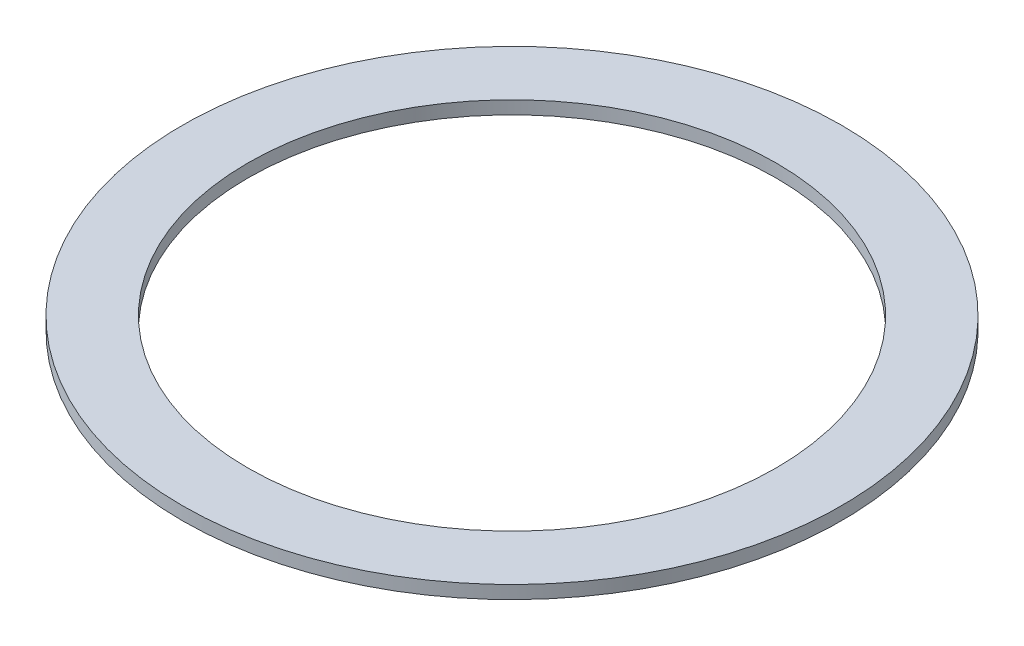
ISO-10303-21;
HEADER;
FILE_DESCRIPTION(('STEP AP214'),'2;1');
FILE_NAME('part.step','',(''),(''),'','','');
FILE_SCHEMA(('AUTOMOTIVE_DESIGN { 1 0 10303 214 1 1 1 1 }'));
ENDSEC;
DATA;
#1=APPLICATION_CONTEXT('core data for automotive mechanical design processes');
#2=APPLICATION_PROTOCOL_DEFINITION('international standard','automotive_design',2000,#1);
#3=PRODUCT_CONTEXT('',#1,'mechanical');
#4=PRODUCT('Part','Part','',(#3));
#5=PRODUCT_RELATED_PRODUCT_CATEGORY('part','',(#4));
#6=PRODUCT_DEFINITION_FORMATION('','',#4);
#7=PRODUCT_DEFINITION_CONTEXT('part definition',#1,'design');
#8=PRODUCT_DEFINITION('design','',#6,#7);
#9=PRODUCT_DEFINITION_SHAPE('','',#8);
#10=(LENGTH_UNIT() NAMED_UNIT(*) SI_UNIT(.MILLI.,.METRE.));
#11=(NAMED_UNIT(*) PLANE_ANGLE_UNIT() SI_UNIT($,.RADIAN.));
#12=(NAMED_UNIT(*) SI_UNIT($,.STERADIAN.) SOLID_ANGLE_UNIT());
#13=UNCERTAINTY_MEASURE_WITH_UNIT(LENGTH_MEASURE(1.E-05),#10,'distance_accuracy_value','');
#14=(GEOMETRIC_REPRESENTATION_CONTEXT(3) GLOBAL_UNCERTAINTY_ASSIGNED_CONTEXT((#13)) GLOBAL_UNIT_ASSIGNED_CONTEXT((#10,
#11,#12)) REPRESENTATION_CONTEXT('',''));
#15=CARTESIAN_POINT('',(0.,0.,0.));
#16=DIRECTION('',(0.,0.,1.));
#17=DIRECTION('',(1.,0.,0.));
#18=AXIS2_PLACEMENT_3D('',#15,#16,#17);
#19=CARTESIAN_POINT('',(0.,2.,0.));
#20=DIRECTION('',(0.,1.,0.));
#21=DIRECTION('',(0.,0.,1.));
#22=AXIS2_PLACEMENT_3D('',#19,#20,#21);
#23=PLANE('',#22);
#24=CARTESIAN_POINT('',(0.,2.,0.));
#25=DIRECTION('',(0.,1.,0.));
#26=DIRECTION('',(0.,0.,1.));
#27=AXIS2_PLACEMENT_3D('',#24,#25,#26);
#28=CIRCLE('',#27,50.4);
#29=CARTESIAN_POINT('',(0.,2.,50.4));
#30=VERTEX_POINT('',#29);
#31=EDGE_CURVE('E10',#30,#30,#28,.T.);
#32=ORIENTED_EDGE('',*,*,#31,.T.);
#33=EDGE_LOOP('',(#32));
#34=FACE_BOUND('',#33,.T.);
#35=CARTESIAN_POINT('',(0.,2.,0.));
#36=DIRECTION('',(0.,1.,0.));
#37=DIRECTION('',(0.,0.,1.));
#38=AXIS2_PLACEMENT_3D('',#35,#36,#37);
#39=CIRCLE('',#38,40.4);
#40=CARTESIAN_POINT('',(0.,2.,40.4));
#41=VERTEX_POINT('',#40);
#42=EDGE_CURVE('E45',#41,#41,#39,.T.);
#43=ORIENTED_EDGE('',*,*,#42,.F.);
#44=EDGE_LOOP('',(#43));
#45=FACE_BOUND('',#44,.T.);
#46=ADVANCED_FACE('F34',(#34,#45),#23,.T.);
#47=CARTESIAN_POINT('',(0.,0.,0.));
#48=DIRECTION('',(0.,1.,0.));
#49=DIRECTION('',(0.,0.,1.));
#50=AXIS2_PLACEMENT_3D('',#47,#48,#49);
#51=PLANE('',#50);
#52=CARTESIAN_POINT('',(0.,0.,0.));
#53=DIRECTION('',(0.,1.,0.));
#54=DIRECTION('',(0.,0.,1.));
#55=AXIS2_PLACEMENT_3D('',#52,#53,#54);
#56=CIRCLE('',#55,50.4);
#57=CARTESIAN_POINT('',(0.,0.,50.4));
#58=VERTEX_POINT('',#57);
#59=EDGE_CURVE('E38',#58,#58,#56,.T.);
#60=ORIENTED_EDGE('',*,*,#59,.F.);
#61=EDGE_LOOP('',(#60));
#62=FACE_BOUND('',#61,.T.);
#63=CARTESIAN_POINT('',(0.,0.,0.));
#64=DIRECTION('',(0.,1.,0.));
#65=DIRECTION('',(0.,0.,1.));
#66=AXIS2_PLACEMENT_3D('',#63,#64,#65);
#67=CIRCLE('',#66,40.4);
#68=CARTESIAN_POINT('',(0.,0.,40.4));
#69=VERTEX_POINT('',#68);
#70=EDGE_CURVE('E47',#69,#69,#67,.T.);
#71=ORIENTED_EDGE('',*,*,#70,.T.);
#72=EDGE_LOOP('',(#71));
#73=FACE_BOUND('',#72,.T.);
#74=ADVANCED_FACE('F57',(#62,#73),#51,.F.);
#75=CARTESIAN_POINT('',(0.,2.,0.));
#76=DIRECTION('',(0.,-1.,0.));
#77=DIRECTION('',(0.,0.,-1.));
#78=AXIS2_PLACEMENT_3D('',#75,#76,#77);
#79=CYLINDRICAL_SURFACE('',#78,50.4);
#80=ORIENTED_EDGE('',*,*,#31,.F.);
#81=EDGE_LOOP('',(#80));
#82=FACE_BOUND('',#81,.T.);
#83=ORIENTED_EDGE('',*,*,#59,.T.);
#84=EDGE_LOOP('',(#83));
#85=FACE_BOUND('',#84,.T.);
#86=ADVANCED_FACE('F36',(#82,#85),#79,.T.);
#87=CARTESIAN_POINT('',(0.,2.,0.));
#88=DIRECTION('',(0.,-1.,0.));
#89=DIRECTION('',(0.,0.,-1.));
#90=AXIS2_PLACEMENT_3D('',#87,#88,#89);
#91=CYLINDRICAL_SURFACE('',#90,40.4);
#92=ORIENTED_EDGE('',*,*,#42,.T.);
#93=EDGE_LOOP('',(#92));
#94=FACE_BOUND('',#93,.T.);
#95=ORIENTED_EDGE('',*,*,#70,.F.);
#96=EDGE_LOOP('',(#95));
#97=FACE_BOUND('',#96,.T.);
#98=ADVANCED_FACE('F53',(#94,#97),#91,.F.);
#99=CLOSED_SHELL('',(#46,#74,#86,#98));
#100=MANIFOLD_SOLID_BREP('B2',#99);
#101=ADVANCED_BREP_SHAPE_REPRESENTATION('',(#18,#100),#14);
#102=SHAPE_DEFINITION_REPRESENTATION(#9,#101);
ENDSEC;
END-ISO-10303-21;
